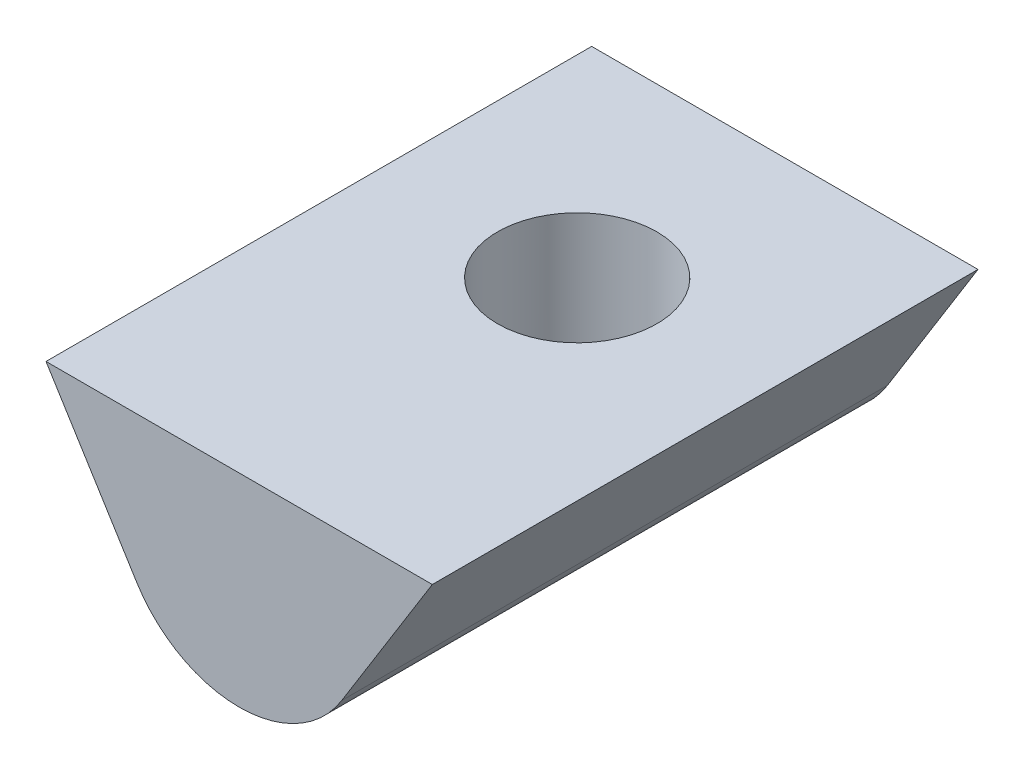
from build123d import *

# Parameters (mm, degrees)
LINEAR_AUSTRAGEN1_DEPTH   = 11.3
M4X0_7_GEWINDEKERNLOCH1_D = 3.3


with BuildPart() as part:
    # Skizze1 → Linear austragen1 (new body)
    with BuildSketch(Plane.XY):
        with BuildLine():
            Line((0, 0), (8, 0))
            Line((8, 0), (6.123342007, -3.019628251))
            ThreePointArc((6.123342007, -3.019628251), (4, -4.2), (1.876657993, -3.019628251))
            Line((1.876657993, -3.019628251), (0, 0))
        make_face()
    extrude(amount=LINEAR_AUSTRAGEN1_DEPTH)

    # M4x0.7 Gewindekernloch1 (through all)
    with Locations(Plane(origin=(0, 0, 0), x_dir=(-1, 0, 0), z_dir=(0, 1, 0))):
        with Locations((-4, 4.3)):
            Hole(M4X0_7_GEWINDEKERNLOCH1_D / 2)


solid = part.part
